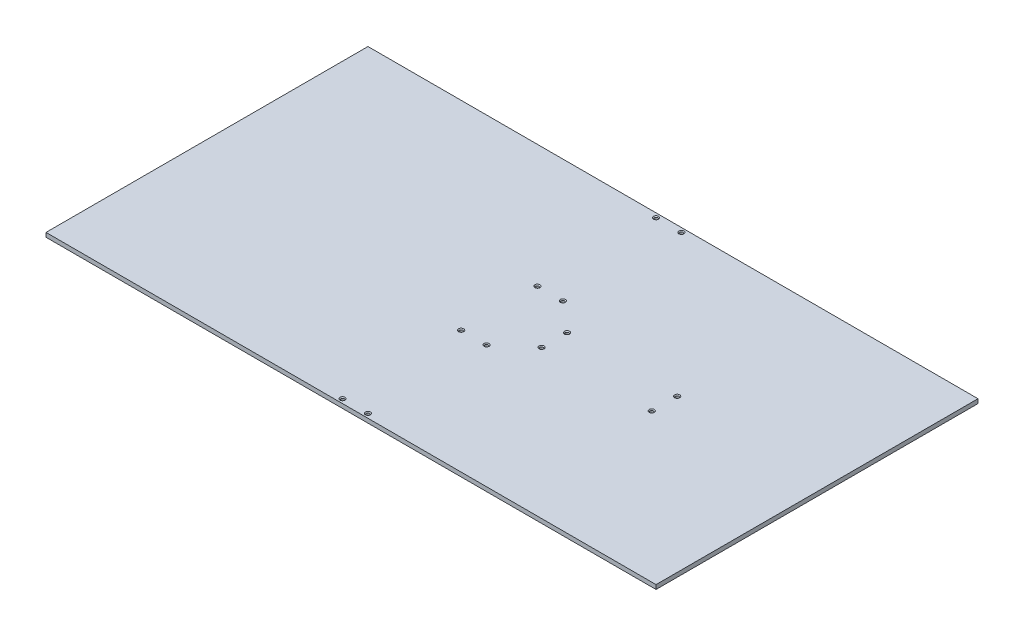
ISO-10303-21;
HEADER;
FILE_DESCRIPTION(('STEP AP214'),'2;1');
FILE_NAME('part.step','',(''),(''),'','','');
FILE_SCHEMA(('AUTOMOTIVE_DESIGN { 1 0 10303 214 1 1 1 1 }'));
ENDSEC;
DATA;
#1=APPLICATION_CONTEXT('core data for automotive mechanical design processes');
#2=APPLICATION_PROTOCOL_DEFINITION('international standard','automotive_design',2000,#1);
#3=PRODUCT_CONTEXT('',#1,'mechanical');
#4=PRODUCT('Part','Part','',(#3));
#5=PRODUCT_RELATED_PRODUCT_CATEGORY('part','',(#4));
#6=PRODUCT_DEFINITION_FORMATION('','',#4);
#7=PRODUCT_DEFINITION_CONTEXT('part definition',#1,'design');
#8=PRODUCT_DEFINITION('design','',#6,#7);
#9=PRODUCT_DEFINITION_SHAPE('','',#8);
#10=(LENGTH_UNIT() NAMED_UNIT(*) SI_UNIT(.MILLI.,.METRE.));
#11=(NAMED_UNIT(*) PLANE_ANGLE_UNIT() SI_UNIT($,.RADIAN.));
#12=(NAMED_UNIT(*) SI_UNIT($,.STERADIAN.) SOLID_ANGLE_UNIT());
#13=UNCERTAINTY_MEASURE_WITH_UNIT(LENGTH_MEASURE(1.E-05),#10,'distance_accuracy_value','');
#14=(GEOMETRIC_REPRESENTATION_CONTEXT(3) GLOBAL_UNCERTAINTY_ASSIGNED_CONTEXT((#13)) GLOBAL_UNIT_ASSIGNED_CONTEXT((#10,
#11,#12)) REPRESENTATION_CONTEXT('',''));
#15=CARTESIAN_POINT('',(0.,0.,0.));
#16=DIRECTION('',(0.,0.,1.));
#17=DIRECTION('',(1.,0.,0.));
#18=AXIS2_PLACEMENT_3D('',#15,#16,#17);
#19=CARTESIAN_POINT('',(0.,6.35,0.));
#20=DIRECTION('',(1.,0.,0.));
#21=DIRECTION('',(0.,0.,-1.));
#22=AXIS2_PLACEMENT_3D('',#19,#20,#21);
#23=PLANE('',#22);
#24=DIRECTION('',(0.,0.,1.));
#25=VECTOR('',#24,1.);
#26=CARTESIAN_POINT('',(0.,0.,0.));
#27=LINE('',#26,#25);
#28=CARTESIAN_POINT('',(0.,0.,-482.6));
#29=VERTEX_POINT('',#28);
#30=CARTESIAN_POINT('',(0.,0.,0.));
#31=VERTEX_POINT('',#30);
#32=EDGE_CURVE('E117',#29,#31,#27,.T.);
#33=ORIENTED_EDGE('',*,*,#32,.T.);
#34=DIRECTION('',(0.,-1.,0.));
#35=VECTOR('',#34,1.);
#36=CARTESIAN_POINT('',(0.,6.35,0.));
#37=LINE('',#36,#35);
#38=CARTESIAN_POINT('',(0.,6.35,0.));
#39=VERTEX_POINT('',#38);
#40=EDGE_CURVE('E11',#39,#31,#37,.T.);
#41=ORIENTED_EDGE('',*,*,#40,.F.);
#42=DIRECTION('',(0.,0.,1.));
#43=VECTOR('',#42,1.);
#44=CARTESIAN_POINT('',(0.,6.35,0.));
#45=LINE('',#44,#43);
#46=CARTESIAN_POINT('',(0.,6.35,-482.6));
#47=VERTEX_POINT('',#46);
#48=EDGE_CURVE('E101',#47,#39,#45,.T.);
#49=ORIENTED_EDGE('',*,*,#48,.F.);
#50=DIRECTION('',(0.,-1.,0.));
#51=VECTOR('',#50,1.);
#52=CARTESIAN_POINT('',(0.,6.35,-482.6));
#53=LINE('',#52,#51);
#54=EDGE_CURVE('E113',#47,#29,#53,.T.);
#55=ORIENTED_EDGE('',*,*,#54,.T.);
#56=EDGE_LOOP('',(#33,#41,#49,#55));
#57=FACE_BOUND('',#56,.T.);
#58=ADVANCED_FACE('F49',(#57),#23,.F.);
#59=CARTESIAN_POINT('',(0.,6.35,0.));
#60=DIRECTION('',(0.,0.,-1.));
#61=DIRECTION('',(-1.,0.,0.));
#62=AXIS2_PLACEMENT_3D('',#59,#60,#61);
#63=PLANE('',#62);
#64=DIRECTION('',(1.,0.,0.));
#65=VECTOR('',#64,1.);
#66=CARTESIAN_POINT('',(0.,0.,0.));
#67=LINE('',#66,#65);
#68=CARTESIAN_POINT('',(914.4,0.,0.));
#69=VERTEX_POINT('',#68);
#70=EDGE_CURVE('E106',#31,#69,#67,.T.);
#71=ORIENTED_EDGE('',*,*,#70,.T.);
#72=DIRECTION('',(0.,-1.,0.));
#73=VECTOR('',#72,1.);
#74=CARTESIAN_POINT('',(914.4,6.35,0.));
#75=LINE('',#74,#73);
#76=CARTESIAN_POINT('',(914.4,6.35,0.));
#77=VERTEX_POINT('',#76);
#78=EDGE_CURVE('E58',#77,#69,#75,.T.);
#79=ORIENTED_EDGE('',*,*,#78,.F.);
#80=DIRECTION('',(1.,0.,0.));
#81=VECTOR('',#80,1.);
#82=CARTESIAN_POINT('',(0.,6.35,0.));
#83=LINE('',#82,#81);
#84=EDGE_CURVE('E96',#39,#77,#83,.T.);
#85=ORIENTED_EDGE('',*,*,#84,.F.);
#86=ORIENTED_EDGE('',*,*,#40,.T.);
#87=EDGE_LOOP('',(#71,#79,#85,#86));
#88=FACE_BOUND('',#87,.T.);
#89=ADVANCED_FACE('F105',(#88),#63,.F.);
#90=CARTESIAN_POINT('',(914.4,6.35,0.));
#91=DIRECTION('',(-1.,0.,0.));
#92=DIRECTION('',(0.,0.,1.));
#93=AXIS2_PLACEMENT_3D('',#90,#91,#92);
#94=PLANE('',#93);
#95=DIRECTION('',(0.,0.,-1.));
#96=VECTOR('',#95,1.);
#97=CARTESIAN_POINT('',(914.4,0.,0.));
#98=LINE('',#97,#96);
#99=CARTESIAN_POINT('',(914.4,0.,-482.6));
#100=VERTEX_POINT('',#99);
#101=EDGE_CURVE('E83',#69,#100,#98,.T.);
#102=ORIENTED_EDGE('',*,*,#101,.T.);
#103=DIRECTION('',(0.,-1.,0.));
#104=VECTOR('',#103,1.);
#105=CARTESIAN_POINT('',(914.4,6.35,-482.6));
#106=LINE('',#105,#104);
#107=CARTESIAN_POINT('',(914.4,6.35,-482.6));
#108=VERTEX_POINT('',#107);
#109=EDGE_CURVE('E108',#108,#100,#106,.T.);
#110=ORIENTED_EDGE('',*,*,#109,.F.);
#111=DIRECTION('',(0.,0.,-1.));
#112=VECTOR('',#111,1.);
#113=CARTESIAN_POINT('',(914.4,6.35,0.));
#114=LINE('',#113,#112);
#115=EDGE_CURVE('E99',#77,#108,#114,.T.);
#116=ORIENTED_EDGE('',*,*,#115,.F.);
#117=ORIENTED_EDGE('',*,*,#78,.T.);
#118=EDGE_LOOP('',(#102,#110,#116,#117));
#119=FACE_BOUND('',#118,.T.);
#120=ADVANCED_FACE('F109',(#119),#94,.F.);
#121=CARTESIAN_POINT('',(0.,6.35,-482.6));
#122=DIRECTION('',(0.,0.,1.));
#123=DIRECTION('',(1.,0.,0.));
#124=AXIS2_PLACEMENT_3D('',#121,#122,#123);
#125=PLANE('',#124);
#126=DIRECTION('',(-1.,0.,0.));
#127=VECTOR('',#126,1.);
#128=CARTESIAN_POINT('',(0.,0.,-482.6));
#129=LINE('',#128,#127);
#130=EDGE_CURVE('E89',#100,#29,#129,.T.);
#131=ORIENTED_EDGE('',*,*,#130,.T.);
#132=ORIENTED_EDGE('',*,*,#54,.F.);
#133=DIRECTION('',(-1.,0.,0.));
#134=VECTOR('',#133,1.);
#135=CARTESIAN_POINT('',(0.,6.35,-482.6));
#136=LINE('',#135,#134);
#137=EDGE_CURVE('E66',#108,#47,#136,.T.);
#138=ORIENTED_EDGE('',*,*,#137,.F.);
#139=ORIENTED_EDGE('',*,*,#109,.T.);
#140=EDGE_LOOP('',(#131,#132,#138,#139));
#141=FACE_BOUND('',#140,.T.);
#142=ADVANCED_FACE('F131',(#141),#125,.F.);
#143=CARTESIAN_POINT('',(0.,6.35,0.));
#144=DIRECTION('',(0.,-1.,0.));
#145=DIRECTION('',(0.,0.,-1.));
#146=AXIS2_PLACEMENT_3D('',#143,#144,#145);
#147=PLANE('',#146);
#148=CARTESIAN_POINT('',(438.15,6.35,-298.45));
#149=DIRECTION('',(0.,1.,0.));
#150=DIRECTION('',(0.,0.,1.));
#151=AXIS2_PLACEMENT_3D('',#148,#149,#150);
#152=CIRCLE('',#151,3.80999999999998);
#153=CARTESIAN_POINT('',(438.15,6.35,-294.64));
#154=VERTEX_POINT('',#153);
#155=EDGE_CURVE('E277',#154,#154,#152,.T.);
#156=ORIENTED_EDGE('',*,*,#155,.F.);
#157=EDGE_LOOP('',(#156));
#158=FACE_BOUND('',#157,.T.);
#159=CARTESIAN_POINT('',(476.25,6.35,-298.45));
#160=DIRECTION('',(0.,1.,0.));
#161=DIRECTION('',(0.,0.,1.));
#162=AXIS2_PLACEMENT_3D('',#159,#160,#161);
#163=CIRCLE('',#162,3.80999999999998);
#164=CARTESIAN_POINT('',(476.25,6.35,-294.64));
#165=VERTEX_POINT('',#164);
#166=EDGE_CURVE('E265',#165,#165,#163,.T.);
#167=ORIENTED_EDGE('',*,*,#166,.F.);
#168=EDGE_LOOP('',(#167));
#169=FACE_BOUND('',#168,.T.);
#170=CARTESIAN_POINT('',(438.15,6.35,-184.15));
#171=DIRECTION('',(0.,1.,0.));
#172=DIRECTION('',(0.,0.,1.));
#173=AXIS2_PLACEMENT_3D('',#170,#171,#172);
#174=CIRCLE('',#173,3.80999999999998);
#175=CARTESIAN_POINT('',(438.15,6.35,-180.34));
#176=VERTEX_POINT('',#175);
#177=EDGE_CURVE('E253',#176,#176,#174,.T.);
#178=ORIENTED_EDGE('',*,*,#177,.F.);
#179=EDGE_LOOP('',(#178));
#180=FACE_BOUND('',#179,.T.);
#181=CARTESIAN_POINT('',(476.25,6.35,-184.15));
#182=DIRECTION('',(0.,1.,0.));
#183=DIRECTION('',(0.,0.,1.));
#184=AXIS2_PLACEMENT_3D('',#181,#182,#183);
#185=CIRCLE('',#184,3.80999999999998);
#186=CARTESIAN_POINT('',(476.25,6.35,-180.34));
#187=VERTEX_POINT('',#186);
#188=EDGE_CURVE('E241',#187,#187,#185,.T.);
#189=ORIENTED_EDGE('',*,*,#188,.F.);
#190=EDGE_LOOP('',(#189));
#191=FACE_BOUND('',#190,.T.);
#192=CARTESIAN_POINT('',(520.7,6.35,-260.35));
#193=DIRECTION('',(0.,1.,0.));
#194=DIRECTION('',(0.,0.,1.));
#195=AXIS2_PLACEMENT_3D('',#192,#193,#194);
#196=CIRCLE('',#195,3.80999999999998);
#197=CARTESIAN_POINT('',(520.7,6.35,-256.54));
#198=VERTEX_POINT('',#197);
#199=EDGE_CURVE('E229',#198,#198,#196,.T.);
#200=ORIENTED_EDGE('',*,*,#199,.F.);
#201=EDGE_LOOP('',(#200));
#202=FACE_BOUND('',#201,.T.);
#203=CARTESIAN_POINT('',(520.7,6.35,-222.25));
#204=DIRECTION('',(0.,1.,0.));
#205=DIRECTION('',(0.,0.,1.));
#206=AXIS2_PLACEMENT_3D('',#203,#204,#205);
#207=CIRCLE('',#206,3.80999999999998);
#208=CARTESIAN_POINT('',(520.7,6.35,-218.44));
#209=VERTEX_POINT('',#208);
#210=EDGE_CURVE('E217',#209,#209,#207,.T.);
#211=ORIENTED_EDGE('',*,*,#210,.F.);
#212=EDGE_LOOP('',(#211));
#213=FACE_BOUND('',#212,.T.);
#214=CARTESIAN_POINT('',(438.15,6.35,-476.25));
#215=DIRECTION('',(0.,1.,0.));
#216=DIRECTION('',(0.,0.,1.));
#217=AXIS2_PLACEMENT_3D('',#214,#215,#216);
#218=CIRCLE('',#217,3.80999999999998);
#219=CARTESIAN_POINT('',(438.15,6.35,-472.44));
#220=VERTEX_POINT('',#219);
#221=EDGE_CURVE('E205',#220,#220,#218,.T.);
#222=ORIENTED_EDGE('',*,*,#221,.F.);
#223=EDGE_LOOP('',(#222));
#224=FACE_BOUND('',#223,.T.);
#225=CARTESIAN_POINT('',(476.25,6.35,-476.25));
#226=DIRECTION('',(0.,1.,0.));
#227=DIRECTION('',(0.,0.,1.));
#228=AXIS2_PLACEMENT_3D('',#225,#226,#227);
#229=CIRCLE('',#228,3.80999999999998);
#230=CARTESIAN_POINT('',(476.25,6.35,-472.44));
#231=VERTEX_POINT('',#230);
#232=EDGE_CURVE('E193',#231,#231,#229,.T.);
#233=ORIENTED_EDGE('',*,*,#232,.F.);
#234=EDGE_LOOP('',(#233));
#235=FACE_BOUND('',#234,.T.);
#236=CARTESIAN_POINT('',(438.15,6.35,-6.35000000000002));
#237=DIRECTION('',(0.,1.,0.));
#238=DIRECTION('',(0.,0.,1.));
#239=AXIS2_PLACEMENT_3D('',#236,#237,#238);
#240=CIRCLE('',#239,3.80999999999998);
#241=CARTESIAN_POINT('',(438.15,6.35,-2.54000000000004));
#242=VERTEX_POINT('',#241);
#243=EDGE_CURVE('E181',#242,#242,#240,.T.);
#244=ORIENTED_EDGE('',*,*,#243,.F.);
#245=EDGE_LOOP('',(#244));
#246=FACE_BOUND('',#245,.T.);
#247=CARTESIAN_POINT('',(476.25,6.35,-6.35000000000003));
#248=DIRECTION('',(0.,1.,0.));
#249=DIRECTION('',(0.,0.,1.));
#250=AXIS2_PLACEMENT_3D('',#247,#248,#249);
#251=CIRCLE('',#250,3.80999999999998);
#252=CARTESIAN_POINT('',(476.25,6.35,-2.54000000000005));
#253=VERTEX_POINT('',#252);
#254=EDGE_CURVE('E169',#253,#253,#251,.T.);
#255=ORIENTED_EDGE('',*,*,#254,.F.);
#256=EDGE_LOOP('',(#255));
#257=FACE_BOUND('',#256,.T.);
#258=CARTESIAN_POINT('',(685.8,6.35,-260.35));
#259=DIRECTION('',(0.,1.,0.));
#260=DIRECTION('',(0.,0.,1.));
#261=AXIS2_PLACEMENT_3D('',#258,#259,#260);
#262=CIRCLE('',#261,3.80999999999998);
#263=CARTESIAN_POINT('',(685.8,6.35,-256.54));
#264=VERTEX_POINT('',#263);
#265=EDGE_CURVE('E157',#264,#264,#262,.T.);
#266=ORIENTED_EDGE('',*,*,#265,.F.);
#267=EDGE_LOOP('',(#266));
#268=FACE_BOUND('',#267,.T.);
#269=CARTESIAN_POINT('',(685.8,6.35,-222.25));
#270=DIRECTION('',(0.,1.,0.));
#271=DIRECTION('',(0.,0.,1.));
#272=AXIS2_PLACEMENT_3D('',#269,#270,#271);
#273=CIRCLE('',#272,3.80999999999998);
#274=CARTESIAN_POINT('',(685.8,6.35,-218.44));
#275=VERTEX_POINT('',#274);
#276=EDGE_CURVE('E145',#275,#275,#273,.T.);
#277=ORIENTED_EDGE('',*,*,#276,.F.);
#278=EDGE_LOOP('',(#277));
#279=FACE_BOUND('',#278,.T.);
#280=ORIENTED_EDGE('',*,*,#48,.T.);
#281=ORIENTED_EDGE('',*,*,#84,.T.);
#282=ORIENTED_EDGE('',*,*,#115,.T.);
#283=ORIENTED_EDGE('',*,*,#137,.T.);
#284=EDGE_LOOP('',(#280,#281,#282,#283));
#285=FACE_BOUND('',#284,.T.);
#286=ADVANCED_FACE('F97',(#158,#169,#180,#191,#202,#213,#224,#235,#246,#257,#268,#279,#285),
#147,.F.);
#287=CARTESIAN_POINT('',(0.,0.,0.));
#288=DIRECTION('',(0.,-1.,0.));
#289=DIRECTION('',(0.,0.,-1.));
#290=AXIS2_PLACEMENT_3D('',#287,#288,#289);
#291=PLANE('',#290);
#292=CARTESIAN_POINT('',(438.15,0.,-298.45));
#293=DIRECTION('',(0.,1.,0.));
#294=DIRECTION('',(0.,0.,1.));
#295=AXIS2_PLACEMENT_3D('',#292,#293,#294);
#296=CIRCLE('',#295,2.55270000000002);
#297=CARTESIAN_POINT('',(438.15,0.,-295.8973));
#298=VERTEX_POINT('',#297);
#299=EDGE_CURVE('E269',#298,#298,#296,.T.);
#300=ORIENTED_EDGE('',*,*,#299,.T.);
#301=EDGE_LOOP('',(#300));
#302=FACE_BOUND('',#301,.T.);
#303=CARTESIAN_POINT('',(476.25,0.,-298.45));
#304=DIRECTION('',(0.,1.,0.));
#305=DIRECTION('',(0.,0.,1.));
#306=AXIS2_PLACEMENT_3D('',#303,#304,#305);
#307=CIRCLE('',#306,2.55270000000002);
#308=CARTESIAN_POINT('',(476.25,0.,-295.8973));
#309=VERTEX_POINT('',#308);
#310=EDGE_CURVE('E257',#309,#309,#307,.T.);
#311=ORIENTED_EDGE('',*,*,#310,.T.);
#312=EDGE_LOOP('',(#311));
#313=FACE_BOUND('',#312,.T.);
#314=CARTESIAN_POINT('',(438.15,0.,-184.15));
#315=DIRECTION('',(0.,1.,0.));
#316=DIRECTION('',(0.,0.,1.));
#317=AXIS2_PLACEMENT_3D('',#314,#315,#316);
#318=CIRCLE('',#317,2.55270000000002);
#319=CARTESIAN_POINT('',(438.15,0.,-181.5973));
#320=VERTEX_POINT('',#319);
#321=EDGE_CURVE('E245',#320,#320,#318,.T.);
#322=ORIENTED_EDGE('',*,*,#321,.T.);
#323=EDGE_LOOP('',(#322));
#324=FACE_BOUND('',#323,.T.);
#325=CARTESIAN_POINT('',(476.25,0.,-184.15));
#326=DIRECTION('',(0.,1.,0.));
#327=DIRECTION('',(0.,0.,1.));
#328=AXIS2_PLACEMENT_3D('',#325,#326,#327);
#329=CIRCLE('',#328,2.55270000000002);
#330=CARTESIAN_POINT('',(476.25,0.,-181.5973));
#331=VERTEX_POINT('',#330);
#332=EDGE_CURVE('E233',#331,#331,#329,.T.);
#333=ORIENTED_EDGE('',*,*,#332,.T.);
#334=EDGE_LOOP('',(#333));
#335=FACE_BOUND('',#334,.T.);
#336=CARTESIAN_POINT('',(520.7,0.,-260.35));
#337=DIRECTION('',(0.,1.,0.));
#338=DIRECTION('',(0.,0.,1.));
#339=AXIS2_PLACEMENT_3D('',#336,#337,#338);
#340=CIRCLE('',#339,2.55269999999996);
#341=CARTESIAN_POINT('',(520.7,0.,-257.7973));
#342=VERTEX_POINT('',#341);
#343=EDGE_CURVE('E221',#342,#342,#340,.T.);
#344=ORIENTED_EDGE('',*,*,#343,.T.);
#345=EDGE_LOOP('',(#344));
#346=FACE_BOUND('',#345,.T.);
#347=CARTESIAN_POINT('',(520.7,0.,-222.25));
#348=DIRECTION('',(0.,1.,0.));
#349=DIRECTION('',(0.,0.,1.));
#350=AXIS2_PLACEMENT_3D('',#347,#348,#349);
#351=CIRCLE('',#350,2.55269999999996);
#352=CARTESIAN_POINT('',(520.7,0.,-219.6973));
#353=VERTEX_POINT('',#352);
#354=EDGE_CURVE('E209',#353,#353,#351,.T.);
#355=ORIENTED_EDGE('',*,*,#354,.T.);
#356=EDGE_LOOP('',(#355));
#357=FACE_BOUND('',#356,.T.);
#358=CARTESIAN_POINT('',(438.15,0.,-476.25));
#359=DIRECTION('',(0.,1.,0.));
#360=DIRECTION('',(0.,0.,1.));
#361=AXIS2_PLACEMENT_3D('',#358,#359,#360);
#362=CIRCLE('',#361,2.55270000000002);
#363=CARTESIAN_POINT('',(438.15,0.,-473.6973));
#364=VERTEX_POINT('',#363);
#365=EDGE_CURVE('E197',#364,#364,#362,.T.);
#366=ORIENTED_EDGE('',*,*,#365,.T.);
#367=EDGE_LOOP('',(#366));
#368=FACE_BOUND('',#367,.T.);
#369=CARTESIAN_POINT('',(476.25,0.,-476.25));
#370=DIRECTION('',(0.,1.,0.));
#371=DIRECTION('',(0.,0.,1.));
#372=AXIS2_PLACEMENT_3D('',#369,#370,#371);
#373=CIRCLE('',#372,2.55270000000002);
#374=CARTESIAN_POINT('',(476.25,0.,-473.6973));
#375=VERTEX_POINT('',#374);
#376=EDGE_CURVE('E185',#375,#375,#373,.T.);
#377=ORIENTED_EDGE('',*,*,#376,.T.);
#378=EDGE_LOOP('',(#377));
#379=FACE_BOUND('',#378,.T.);
#380=CARTESIAN_POINT('',(438.15,0.,-6.35000000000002));
#381=DIRECTION('',(0.,1.,0.));
#382=DIRECTION('',(0.,0.,1.));
#383=AXIS2_PLACEMENT_3D('',#380,#381,#382);
#384=CIRCLE('',#383,2.55270000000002);
#385=CARTESIAN_POINT('',(438.15,0.,-3.7973));
#386=VERTEX_POINT('',#385);
#387=EDGE_CURVE('E173',#386,#386,#384,.T.);
#388=ORIENTED_EDGE('',*,*,#387,.T.);
#389=EDGE_LOOP('',(#388));
#390=FACE_BOUND('',#389,.T.);
#391=CARTESIAN_POINT('',(476.25,0.,-6.35000000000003));
#392=DIRECTION('',(0.,1.,0.));
#393=DIRECTION('',(0.,0.,1.));
#394=AXIS2_PLACEMENT_3D('',#391,#392,#393);
#395=CIRCLE('',#394,2.55270000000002);
#396=CARTESIAN_POINT('',(476.25,0.,-3.79730000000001));
#397=VERTEX_POINT('',#396);
#398=EDGE_CURVE('E161',#397,#397,#395,.T.);
#399=ORIENTED_EDGE('',*,*,#398,.T.);
#400=EDGE_LOOP('',(#399));
#401=FACE_BOUND('',#400,.T.);
#402=CARTESIAN_POINT('',(685.8,0.,-260.35));
#403=DIRECTION('',(0.,1.,0.));
#404=DIRECTION('',(0.,0.,1.));
#405=AXIS2_PLACEMENT_3D('',#402,#403,#404);
#406=CIRCLE('',#405,2.55269999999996);
#407=CARTESIAN_POINT('',(685.8,0.,-257.7973));
#408=VERTEX_POINT('',#407);
#409=EDGE_CURVE('E149',#408,#408,#406,.T.);
#410=ORIENTED_EDGE('',*,*,#409,.T.);
#411=EDGE_LOOP('',(#410));
#412=FACE_BOUND('',#411,.T.);
#413=CARTESIAN_POINT('',(685.8,0.,-222.25));
#414=DIRECTION('',(0.,1.,0.));
#415=DIRECTION('',(0.,0.,1.));
#416=AXIS2_PLACEMENT_3D('',#413,#414,#415);
#417=CIRCLE('',#416,2.55269999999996);
#418=CARTESIAN_POINT('',(685.8,0.,-219.6973));
#419=VERTEX_POINT('',#418);
#420=EDGE_CURVE('E121',#419,#419,#417,.T.);
#421=ORIENTED_EDGE('',*,*,#420,.T.);
#422=EDGE_LOOP('',(#421));
#423=FACE_BOUND('',#422,.T.);
#424=ORIENTED_EDGE('',*,*,#32,.F.);
#425=ORIENTED_EDGE('',*,*,#130,.F.);
#426=ORIENTED_EDGE('',*,*,#101,.F.);
#427=ORIENTED_EDGE('',*,*,#70,.F.);
#428=EDGE_LOOP('',(#424,#425,#426,#427));
#429=FACE_BOUND('',#428,.T.);
#430=ADVANCED_FACE('F134',(#302,#313,#324,#335,#346,#357,#368,#379,#390,#401,#412,#423,#429),
#291,.T.);
#431=CARTESIAN_POINT('',(685.8,6.35,-222.25));
#432=DIRECTION('',(0.,1.,0.));
#433=DIRECTION('',(0.,0.,1.));
#434=AXIS2_PLACEMENT_3D('',#431,#432,#433);
#435=CYLINDRICAL_SURFACE('',#434,2.55269999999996);
#436=ORIENTED_EDGE('',*,*,#420,.F.);
#437=EDGE_LOOP('',(#436));
#438=FACE_BOUND('',#437,.T.);
#439=CARTESIAN_POINT('',(685.8,5.0927,-222.25));
#440=DIRECTION('',(0.,1.,0.));
#441=DIRECTION('',(0.,0.,1.));
#442=AXIS2_PLACEMENT_3D('',#439,#440,#441);
#443=CIRCLE('',#442,2.55269999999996);
#444=CARTESIAN_POINT('',(685.8,5.0927,-219.6973));
#445=VERTEX_POINT('',#444);
#446=EDGE_CURVE('E141',#445,#445,#443,.T.);
#447=ORIENTED_EDGE('',*,*,#446,.T.);
#448=EDGE_LOOP('',(#447));
#449=FACE_BOUND('',#448,.T.);
#450=ADVANCED_FACE('F312',(#438,#449),#435,.F.);
#451=CARTESIAN_POINT('',(685.8,6.35,-222.25));
#452=DIRECTION('',(0.,1.,0.));
#453=DIRECTION('',(0.,0.,1.));
#454=AXIS2_PLACEMENT_3D('',#451,#452,#453);
#455=CONICAL_SURFACE('',#454,3.80999999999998,0.785398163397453);
#456=ORIENTED_EDGE('',*,*,#446,.F.);
#457=EDGE_LOOP('',(#456));
#458=FACE_BOUND('',#457,.T.);
#459=ORIENTED_EDGE('',*,*,#276,.T.);
#460=EDGE_LOOP('',(#459));
#461=FACE_BOUND('',#460,.T.);
#462=ADVANCED_FACE('F309',(#458,#461),#455,.F.);
#463=CARTESIAN_POINT('',(685.8,6.35,-260.35));
#464=DIRECTION('',(0.,1.,0.));
#465=DIRECTION('',(0.,0.,1.));
#466=AXIS2_PLACEMENT_3D('',#463,#464,#465);
#467=CYLINDRICAL_SURFACE('',#466,2.55269999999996);
#468=ORIENTED_EDGE('',*,*,#409,.F.);
#469=EDGE_LOOP('',(#468));
#470=FACE_BOUND('',#469,.T.);
#471=CARTESIAN_POINT('',(685.8,5.0927,-260.35));
#472=DIRECTION('',(0.,1.,0.));
#473=DIRECTION('',(0.,0.,1.));
#474=AXIS2_PLACEMENT_3D('',#471,#472,#473);
#475=CIRCLE('',#474,2.55269999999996);
#476=CARTESIAN_POINT('',(685.8,5.0927,-257.7973));
#477=VERTEX_POINT('',#476);
#478=EDGE_CURVE('E153',#477,#477,#475,.T.);
#479=ORIENTED_EDGE('',*,*,#478,.T.);
#480=EDGE_LOOP('',(#479));
#481=FACE_BOUND('',#480,.T.);
#482=ADVANCED_FACE('F311',(#470,#481),#467,.F.);
#483=CARTESIAN_POINT('',(685.8,6.35,-260.35));
#484=DIRECTION('',(0.,1.,0.));
#485=DIRECTION('',(0.,0.,1.));
#486=AXIS2_PLACEMENT_3D('',#483,#484,#485);
#487=CONICAL_SURFACE('',#486,3.80999999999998,0.785398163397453);
#488=ORIENTED_EDGE('',*,*,#478,.F.);
#489=EDGE_LOOP('',(#488));
#490=FACE_BOUND('',#489,.T.);
#491=ORIENTED_EDGE('',*,*,#265,.T.);
#492=EDGE_LOOP('',(#491));
#493=FACE_BOUND('',#492,.T.);
#494=ADVANCED_FACE('F319',(#490,#493),#487,.F.);
#495=CARTESIAN_POINT('',(476.25,6.35,-6.35000000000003));
#496=DIRECTION('',(0.,1.,0.));
#497=DIRECTION('',(0.,0.,1.));
#498=AXIS2_PLACEMENT_3D('',#495,#496,#497);
#499=CYLINDRICAL_SURFACE('',#498,2.55269999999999);
#500=ORIENTED_EDGE('',*,*,#398,.F.);
#501=EDGE_LOOP('',(#500));
#502=FACE_BOUND('',#501,.T.);
#503=CARTESIAN_POINT('',(476.25,5.0927,-6.35000000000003));
#504=DIRECTION('',(0.,1.,0.));
#505=DIRECTION('',(0.,0.,1.));
#506=AXIS2_PLACEMENT_3D('',#503,#504,#505);
#507=CIRCLE('',#506,2.55269999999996);
#508=CARTESIAN_POINT('',(476.25,5.0927,-3.79730000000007));
#509=VERTEX_POINT('',#508);
#510=EDGE_CURVE('E165',#509,#509,#507,.T.);
#511=ORIENTED_EDGE('',*,*,#510,.T.);
#512=EDGE_LOOP('',(#511));
#513=FACE_BOUND('',#512,.T.);
#514=ADVANCED_FACE('F370',(#502,#513),#499,.F.);
#515=CARTESIAN_POINT('',(476.25,6.35,-6.35000000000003));
#516=DIRECTION('',(0.,1.,0.));
#517=DIRECTION('',(0.,0.,1.));
#518=AXIS2_PLACEMENT_3D('',#515,#516,#517);
#519=CONICAL_SURFACE('',#518,3.80999999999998,0.785398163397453);
#520=ORIENTED_EDGE('',*,*,#510,.F.);
#521=EDGE_LOOP('',(#520));
#522=FACE_BOUND('',#521,.T.);
#523=ORIENTED_EDGE('',*,*,#254,.T.);
#524=EDGE_LOOP('',(#523));
#525=FACE_BOUND('',#524,.T.);
#526=ADVANCED_FACE('F375',(#522,#525),#519,.F.);
#527=CARTESIAN_POINT('',(438.15,6.35,-6.35000000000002));
#528=DIRECTION('',(0.,1.,0.));
#529=DIRECTION('',(0.,0.,1.));
#530=AXIS2_PLACEMENT_3D('',#527,#528,#529);
#531=CYLINDRICAL_SURFACE('',#530,2.55269999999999);
#532=ORIENTED_EDGE('',*,*,#387,.F.);
#533=EDGE_LOOP('',(#532));
#534=FACE_BOUND('',#533,.T.);
#535=CARTESIAN_POINT('',(438.15,5.0927,-6.35000000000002));
#536=DIRECTION('',(0.,1.,0.));
#537=DIRECTION('',(0.,0.,1.));
#538=AXIS2_PLACEMENT_3D('',#535,#536,#537);
#539=CIRCLE('',#538,2.55269999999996);
#540=CARTESIAN_POINT('',(438.15,5.0927,-3.79730000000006));
#541=VERTEX_POINT('',#540);
#542=EDGE_CURVE('E177',#541,#541,#539,.T.);
#543=ORIENTED_EDGE('',*,*,#542,.T.);
#544=EDGE_LOOP('',(#543));
#545=FACE_BOUND('',#544,.T.);
#546=ADVANCED_FACE('F381',(#534,#545),#531,.F.);
#547=CARTESIAN_POINT('',(438.15,6.35,-6.35000000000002));
#548=DIRECTION('',(0.,1.,0.));
#549=DIRECTION('',(0.,0.,1.));
#550=AXIS2_PLACEMENT_3D('',#547,#548,#549);
#551=CONICAL_SURFACE('',#550,3.80999999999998,0.785398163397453);
#552=ORIENTED_EDGE('',*,*,#542,.F.);
#553=EDGE_LOOP('',(#552));
#554=FACE_BOUND('',#553,.T.);
#555=ORIENTED_EDGE('',*,*,#243,.T.);
#556=EDGE_LOOP('',(#555));
#557=FACE_BOUND('',#556,.T.);
#558=ADVANCED_FACE('F385',(#554,#557),#551,.F.);
#559=CARTESIAN_POINT('',(476.25,6.35,-476.25));
#560=DIRECTION('',(0.,1.,0.));
#561=DIRECTION('',(0.,0.,1.));
#562=AXIS2_PLACEMENT_3D('',#559,#560,#561);
#563=CYLINDRICAL_SURFACE('',#562,2.55269999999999);
#564=ORIENTED_EDGE('',*,*,#376,.F.);
#565=EDGE_LOOP('',(#564));
#566=FACE_BOUND('',#565,.T.);
#567=CARTESIAN_POINT('',(476.25,5.0927,-476.25));
#568=DIRECTION('',(0.,1.,0.));
#569=DIRECTION('',(0.,0.,1.));
#570=AXIS2_PLACEMENT_3D('',#567,#568,#569);
#571=CIRCLE('',#570,2.55269999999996);
#572=CARTESIAN_POINT('',(476.25,5.0927,-473.6973));
#573=VERTEX_POINT('',#572);
#574=EDGE_CURVE('E189',#573,#573,#571,.T.);
#575=ORIENTED_EDGE('',*,*,#574,.T.);
#576=EDGE_LOOP('',(#575));
#577=FACE_BOUND('',#576,.T.);
#578=ADVANCED_FACE('F389',(#566,#577),#563,.F.);
#579=CARTESIAN_POINT('',(476.25,6.35,-476.25));
#580=DIRECTION('',(0.,1.,0.));
#581=DIRECTION('',(0.,0.,1.));
#582=AXIS2_PLACEMENT_3D('',#579,#580,#581);
#583=CONICAL_SURFACE('',#582,3.80999999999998,0.785398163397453);
#584=ORIENTED_EDGE('',*,*,#574,.F.);
#585=EDGE_LOOP('',(#584));
#586=FACE_BOUND('',#585,.T.);
#587=ORIENTED_EDGE('',*,*,#232,.T.);
#588=EDGE_LOOP('',(#587));
#589=FACE_BOUND('',#588,.T.);
#590=ADVANCED_FACE('F393',(#586,#589),#583,.F.);
#591=CARTESIAN_POINT('',(438.15,6.35,-476.25));
#592=DIRECTION('',(0.,1.,0.));
#593=DIRECTION('',(0.,0.,1.));
#594=AXIS2_PLACEMENT_3D('',#591,#592,#593);
#595=CYLINDRICAL_SURFACE('',#594,2.55269999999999);
#596=ORIENTED_EDGE('',*,*,#365,.F.);
#597=EDGE_LOOP('',(#596));
#598=FACE_BOUND('',#597,.T.);
#599=CARTESIAN_POINT('',(438.15,5.0927,-476.25));
#600=DIRECTION('',(0.,1.,0.));
#601=DIRECTION('',(0.,0.,1.));
#602=AXIS2_PLACEMENT_3D('',#599,#600,#601);
#603=CIRCLE('',#602,2.55269999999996);
#604=CARTESIAN_POINT('',(438.15,5.0927,-473.6973));
#605=VERTEX_POINT('',#604);
#606=EDGE_CURVE('E201',#605,#605,#603,.T.);
#607=ORIENTED_EDGE('',*,*,#606,.T.);
#608=EDGE_LOOP('',(#607));
#609=FACE_BOUND('',#608,.T.);
#610=ADVANCED_FACE('F397',(#598,#609),#595,.F.);
#611=CARTESIAN_POINT('',(438.15,6.35,-476.25));
#612=DIRECTION('',(0.,1.,0.));
#613=DIRECTION('',(0.,0.,1.));
#614=AXIS2_PLACEMENT_3D('',#611,#612,#613);
#615=CONICAL_SURFACE('',#614,3.80999999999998,0.785398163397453);
#616=ORIENTED_EDGE('',*,*,#606,.F.);
#617=EDGE_LOOP('',(#616));
#618=FACE_BOUND('',#617,.T.);
#619=ORIENTED_EDGE('',*,*,#221,.T.);
#620=EDGE_LOOP('',(#619));
#621=FACE_BOUND('',#620,.T.);
#622=ADVANCED_FACE('F401',(#618,#621),#615,.F.);
#623=CARTESIAN_POINT('',(520.7,6.35,-222.25));
#624=DIRECTION('',(0.,1.,0.));
#625=DIRECTION('',(0.,0.,1.));
#626=AXIS2_PLACEMENT_3D('',#623,#624,#625);
#627=CYLINDRICAL_SURFACE('',#626,2.55269999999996);
#628=ORIENTED_EDGE('',*,*,#354,.F.);
#629=EDGE_LOOP('',(#628));
#630=FACE_BOUND('',#629,.T.);
#631=CARTESIAN_POINT('',(520.7,5.0927,-222.25));
#632=DIRECTION('',(0.,1.,0.));
#633=DIRECTION('',(0.,0.,1.));
#634=AXIS2_PLACEMENT_3D('',#631,#632,#633);
#635=CIRCLE('',#634,2.55269999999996);
#636=CARTESIAN_POINT('',(520.7,5.0927,-219.6973));
#637=VERTEX_POINT('',#636);
#638=EDGE_CURVE('E213',#637,#637,#635,.T.);
#639=ORIENTED_EDGE('',*,*,#638,.T.);
#640=EDGE_LOOP('',(#639));
#641=FACE_BOUND('',#640,.T.);
#642=ADVANCED_FACE('F405',(#630,#641),#627,.F.);
#643=CARTESIAN_POINT('',(520.7,6.35,-222.25));
#644=DIRECTION('',(0.,1.,0.));
#645=DIRECTION('',(0.,0.,1.));
#646=AXIS2_PLACEMENT_3D('',#643,#644,#645);
#647=CONICAL_SURFACE('',#646,3.80999999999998,0.785398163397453);
#648=ORIENTED_EDGE('',*,*,#638,.F.);
#649=EDGE_LOOP('',(#648));
#650=FACE_BOUND('',#649,.T.);
#651=ORIENTED_EDGE('',*,*,#210,.T.);
#652=EDGE_LOOP('',(#651));
#653=FACE_BOUND('',#652,.T.);
#654=ADVANCED_FACE('F409',(#650,#653),#647,.F.);
#655=CARTESIAN_POINT('',(520.7,6.35,-260.35));
#656=DIRECTION('',(0.,1.,0.));
#657=DIRECTION('',(0.,0.,1.));
#658=AXIS2_PLACEMENT_3D('',#655,#656,#657);
#659=CYLINDRICAL_SURFACE('',#658,2.55269999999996);
#660=ORIENTED_EDGE('',*,*,#343,.F.);
#661=EDGE_LOOP('',(#660));
#662=FACE_BOUND('',#661,.T.);
#663=CARTESIAN_POINT('',(520.7,5.0927,-260.35));
#664=DIRECTION('',(0.,1.,0.));
#665=DIRECTION('',(0.,0.,1.));
#666=AXIS2_PLACEMENT_3D('',#663,#664,#665);
#667=CIRCLE('',#666,2.55269999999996);
#668=CARTESIAN_POINT('',(520.7,5.0927,-257.7973));
#669=VERTEX_POINT('',#668);
#670=EDGE_CURVE('E225',#669,#669,#667,.T.);
#671=ORIENTED_EDGE('',*,*,#670,.T.);
#672=EDGE_LOOP('',(#671));
#673=FACE_BOUND('',#672,.T.);
#674=ADVANCED_FACE('F413',(#662,#673),#659,.F.);
#675=CARTESIAN_POINT('',(520.7,6.35,-260.35));
#676=DIRECTION('',(0.,1.,0.));
#677=DIRECTION('',(0.,0.,1.));
#678=AXIS2_PLACEMENT_3D('',#675,#676,#677);
#679=CONICAL_SURFACE('',#678,3.80999999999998,0.785398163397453);
#680=ORIENTED_EDGE('',*,*,#670,.F.);
#681=EDGE_LOOP('',(#680));
#682=FACE_BOUND('',#681,.T.);
#683=ORIENTED_EDGE('',*,*,#199,.T.);
#684=EDGE_LOOP('',(#683));
#685=FACE_BOUND('',#684,.T.);
#686=ADVANCED_FACE('F417',(#682,#685),#679,.F.);
#687=CARTESIAN_POINT('',(476.25,6.35,-184.15));
#688=DIRECTION('',(0.,1.,0.));
#689=DIRECTION('',(0.,0.,1.));
#690=AXIS2_PLACEMENT_3D('',#687,#688,#689);
#691=CYLINDRICAL_SURFACE('',#690,2.55269999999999);
#692=ORIENTED_EDGE('',*,*,#332,.F.);
#693=EDGE_LOOP('',(#692));
#694=FACE_BOUND('',#693,.T.);
#695=CARTESIAN_POINT('',(476.25,5.0927,-184.15));
#696=DIRECTION('',(0.,1.,0.));
#697=DIRECTION('',(0.,0.,1.));
#698=AXIS2_PLACEMENT_3D('',#695,#696,#697);
#699=CIRCLE('',#698,2.55269999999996);
#700=CARTESIAN_POINT('',(476.25,5.0927,-181.5973));
#701=VERTEX_POINT('',#700);
#702=EDGE_CURVE('E237',#701,#701,#699,.T.);
#703=ORIENTED_EDGE('',*,*,#702,.T.);
#704=EDGE_LOOP('',(#703));
#705=FACE_BOUND('',#704,.T.);
#706=ADVANCED_FACE('F421',(#694,#705),#691,.F.);
#707=CARTESIAN_POINT('',(476.25,6.35,-184.15));
#708=DIRECTION('',(0.,1.,0.));
#709=DIRECTION('',(0.,0.,1.));
#710=AXIS2_PLACEMENT_3D('',#707,#708,#709);
#711=CONICAL_SURFACE('',#710,3.80999999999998,0.785398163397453);
#712=ORIENTED_EDGE('',*,*,#702,.F.);
#713=EDGE_LOOP('',(#712));
#714=FACE_BOUND('',#713,.T.);
#715=ORIENTED_EDGE('',*,*,#188,.T.);
#716=EDGE_LOOP('',(#715));
#717=FACE_BOUND('',#716,.T.);
#718=ADVANCED_FACE('F425',(#714,#717),#711,.F.);
#719=CARTESIAN_POINT('',(438.15,6.35,-184.15));
#720=DIRECTION('',(0.,1.,0.));
#721=DIRECTION('',(0.,0.,1.));
#722=AXIS2_PLACEMENT_3D('',#719,#720,#721);
#723=CYLINDRICAL_SURFACE('',#722,2.55269999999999);
#724=ORIENTED_EDGE('',*,*,#321,.F.);
#725=EDGE_LOOP('',(#724));
#726=FACE_BOUND('',#725,.T.);
#727=CARTESIAN_POINT('',(438.15,5.0927,-184.15));
#728=DIRECTION('',(0.,1.,0.));
#729=DIRECTION('',(0.,0.,1.));
#730=AXIS2_PLACEMENT_3D('',#727,#728,#729);
#731=CIRCLE('',#730,2.55269999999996);
#732=CARTESIAN_POINT('',(438.15,5.0927,-181.5973));
#733=VERTEX_POINT('',#732);
#734=EDGE_CURVE('E249',#733,#733,#731,.T.);
#735=ORIENTED_EDGE('',*,*,#734,.T.);
#736=EDGE_LOOP('',(#735));
#737=FACE_BOUND('',#736,.T.);
#738=ADVANCED_FACE('F429',(#726,#737),#723,.F.);
#739=CARTESIAN_POINT('',(438.15,6.35,-184.15));
#740=DIRECTION('',(0.,1.,0.));
#741=DIRECTION('',(0.,0.,1.));
#742=AXIS2_PLACEMENT_3D('',#739,#740,#741);
#743=CONICAL_SURFACE('',#742,3.80999999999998,0.785398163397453);
#744=ORIENTED_EDGE('',*,*,#734,.F.);
#745=EDGE_LOOP('',(#744));
#746=FACE_BOUND('',#745,.T.);
#747=ORIENTED_EDGE('',*,*,#177,.T.);
#748=EDGE_LOOP('',(#747));
#749=FACE_BOUND('',#748,.T.);
#750=ADVANCED_FACE('F433',(#746,#749),#743,.F.);
#751=CARTESIAN_POINT('',(476.25,6.35,-298.45));
#752=DIRECTION('',(0.,1.,0.));
#753=DIRECTION('',(0.,0.,1.));
#754=AXIS2_PLACEMENT_3D('',#751,#752,#753);
#755=CYLINDRICAL_SURFACE('',#754,2.55269999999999);
#756=ORIENTED_EDGE('',*,*,#310,.F.);
#757=EDGE_LOOP('',(#756));
#758=FACE_BOUND('',#757,.T.);
#759=CARTESIAN_POINT('',(476.25,5.0927,-298.45));
#760=DIRECTION('',(0.,1.,0.));
#761=DIRECTION('',(0.,0.,1.));
#762=AXIS2_PLACEMENT_3D('',#759,#760,#761);
#763=CIRCLE('',#762,2.55269999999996);
#764=CARTESIAN_POINT('',(476.25,5.0927,-295.8973));
#765=VERTEX_POINT('',#764);
#766=EDGE_CURVE('E261',#765,#765,#763,.T.);
#767=ORIENTED_EDGE('',*,*,#766,.T.);
#768=EDGE_LOOP('',(#767));
#769=FACE_BOUND('',#768,.T.);
#770=ADVANCED_FACE('F437',(#758,#769),#755,.F.);
#771=CARTESIAN_POINT('',(476.25,6.35,-298.45));
#772=DIRECTION('',(0.,1.,0.));
#773=DIRECTION('',(0.,0.,1.));
#774=AXIS2_PLACEMENT_3D('',#771,#772,#773);
#775=CONICAL_SURFACE('',#774,3.80999999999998,0.785398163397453);
#776=ORIENTED_EDGE('',*,*,#766,.F.);
#777=EDGE_LOOP('',(#776));
#778=FACE_BOUND('',#777,.T.);
#779=ORIENTED_EDGE('',*,*,#166,.T.);
#780=EDGE_LOOP('',(#779));
#781=FACE_BOUND('',#780,.T.);
#782=ADVANCED_FACE('F441',(#778,#781),#775,.F.);
#783=CARTESIAN_POINT('',(438.15,6.35,-298.45));
#784=DIRECTION('',(0.,1.,0.));
#785=DIRECTION('',(0.,0.,1.));
#786=AXIS2_PLACEMENT_3D('',#783,#784,#785);
#787=CYLINDRICAL_SURFACE('',#786,2.55269999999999);
#788=ORIENTED_EDGE('',*,*,#299,.F.);
#789=EDGE_LOOP('',(#788));
#790=FACE_BOUND('',#789,.T.);
#791=CARTESIAN_POINT('',(438.15,5.0927,-298.45));
#792=DIRECTION('',(0.,1.,0.));
#793=DIRECTION('',(0.,0.,1.));
#794=AXIS2_PLACEMENT_3D('',#791,#792,#793);
#795=CIRCLE('',#794,2.55269999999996);
#796=CARTESIAN_POINT('',(438.15,5.0927,-295.8973));
#797=VERTEX_POINT('',#796);
#798=EDGE_CURVE('E273',#797,#797,#795,.T.);
#799=ORIENTED_EDGE('',*,*,#798,.T.);
#800=EDGE_LOOP('',(#799));
#801=FACE_BOUND('',#800,.T.);
#802=ADVANCED_FACE('F445',(#790,#801),#787,.F.);
#803=CARTESIAN_POINT('',(438.15,6.35,-298.45));
#804=DIRECTION('',(0.,1.,0.));
#805=DIRECTION('',(0.,0.,1.));
#806=AXIS2_PLACEMENT_3D('',#803,#804,#805);
#807=CONICAL_SURFACE('',#806,3.80999999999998,0.785398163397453);
#808=ORIENTED_EDGE('',*,*,#798,.F.);
#809=EDGE_LOOP('',(#808));
#810=FACE_BOUND('',#809,.T.);
#811=ORIENTED_EDGE('',*,*,#155,.T.);
#812=EDGE_LOOP('',(#811));
#813=FACE_BOUND('',#812,.T.);
#814=ADVANCED_FACE('F282',(#810,#813),#807,.F.);
#815=CLOSED_SHELL('',(#58,#89,#120,#142,#286,#430,#450,#462,#482,#494,#514,#526,#546,#558,#578,
#590,#610,#622,#642,#654,#674,#686,#706,#718,#738,#750,#770,#782,#802,#814));
#816=MANIFOLD_SOLID_BREP('B2',#815);
#817=ADVANCED_BREP_SHAPE_REPRESENTATION('',(#18,#816),#14);
#818=SHAPE_DEFINITION_REPRESENTATION(#9,#817);
ENDSEC;
END-ISO-10303-21;
